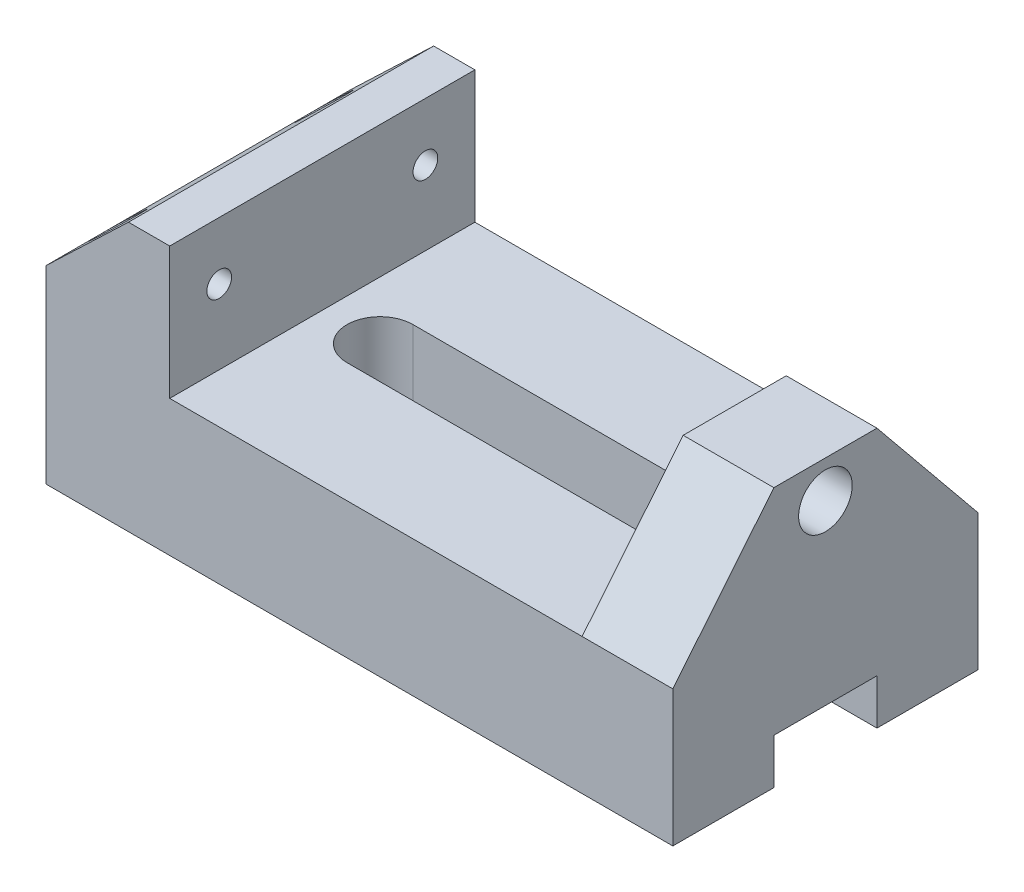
from build123d import *

# Parameters (mm, degrees)
SKETCH1_W           = 152
SKETCH1_H           = 65
BOSS_EXTRUDE1_DEPTH = 37
CHAMFER1_SIZE       = 20
CHAMFER1_SIZE2      = 18
SKETCH2_W           = 100
SKETCH2_H           = 32
CUT_EXTRUDE1_DEPTH  = 74
CHAMFER2_SIZE       = 26.135
CHAMFER2_SIZE2      = 32
CHAMFER3_SIZE       = 32
CHAMFER3_SIZE2      = 26.135
SKETCH3_W           = 25
SKETCH3_H           = 11
CUT_EXTRUDE2_DEPTH  = 152
SKETCH4_R           = 6.5
CUT_EXTRUDE3_DEPTH  = 22
SKETCH5_R           = 8
CUT_EXTRUDE4_DEPTH  = 13
CUT_EXTRUDE5_DEPTH  = 22
SKETCH14_W          = 10
SKETCH14_H          = 74
BOSS_EXTRUDE3_DEPTH = 2
BOSS_EXTRUDE4_DEPTH = 74
SKETCH30_W          = 0.314102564
SKETCH30_H          = 3.5
CUT_EXTRUDE6_DEPTH  = 2
CUT_EXTRUDE7_DEPTH  = 74
CUT_EXTRUDE8_DEPTH  = 22
CUT_EXTRUDE10_START = -74
CUT_EXTRUDE10_DEPTH = 74


with BuildPart() as part:
    # Sketch1 → Boss-Extrude1 (new, symmetric)
    with BuildSketch(Plane.XY):
        Rectangle(SKETCH1_W, SKETCH1_H)
    extrude(amount=BOSS_EXTRUDE1_DEPTH, both=True)

    # Chamfer1
    chamfer1_edges = [part.edges().sort_by_distance(p)[0] for p in [
        (-76, 32.5, 0),
    ]]
    chamfer1_side = [part.faces().sort_by_distance(p)[0] for p in [
        (0, 32.5, 0),
    ]]
    chamfer(chamfer1_edges, length=CHAMFER1_SIZE, length2=CHAMFER1_SIZE2, reference=chamfer1_side[0])

    # Sketch2 → Cut-Extrude1 (cut)
    with BuildSketch(Plane.XY.offset(37)):
        with Locations((4, 16.5)):
            Rectangle(SKETCH2_W, SKETCH2_H)
    extrude(amount=-CUT_EXTRUDE1_DEPTH, mode=Mode.SUBTRACT)

    # Chamfer2
    chamfer2_edges = [part.edges().sort_by_distance(p)[0] for p in [
        (65, 32.5, 37),
    ]]
    chamfer2_side = [part.faces().sort_by_distance(p)[0] for p in [
        (65, 32.5, 0),
    ]]
    chamfer(chamfer2_edges, length=CHAMFER2_SIZE, length2=CHAMFER2_SIZE2, reference=chamfer2_side[0])

    # Chamfer3
    chamfer3_edges = [part.edges().sort_by_distance(p)[0] for p in [
        (65, 32.5, -37),
    ]]
    chamfer3_side = [part.faces().sort_by_distance(p)[0] for p in [
        (-0.049230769, -8.856923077, -37),
    ]]
    chamfer(chamfer3_edges, length=CHAMFER3_SIZE, length2=CHAMFER3_SIZE2, reference=chamfer3_side[0])

    # Sketch3 → Cut-Extrude2 (cut)
    with BuildSketch(Plane(origin=(76, 0, 0), x_dir=(0, 0, -1), z_dir=(1, 0, 0))):
        with Locations((0, -27)):
            Rectangle(SKETCH3_W, SKETCH3_H)
    extrude(amount=-CUT_EXTRUDE2_DEPTH, mode=Mode.SUBTRACT)

    # Sketch4 → Cut-Extrude3 (cut)
    with BuildSketch(Plane(origin=(76, 0, 0), x_dir=(0, 0, -1), z_dir=(1, 0, 0))):
        with Locations((0, 21.5)):
            Circle(SKETCH4_R)
    extrude(amount=-CUT_EXTRUDE3_DEPTH, mode=Mode.SUBTRACT)

    # Sketch5 → Cut-Extrude4 (cut)
    with BuildSketch(Plane.ZY.offset(76)):
        with Locations((0, -7.5)):
            Circle(SKETCH5_R)
    extrude(amount=-CUT_EXTRUDE4_DEPTH, mode=Mode.SUBTRACT)

    # Sketch6 → Cut-Extrude5 (cut)
    with BuildSketch(Plane(origin=(0, 0.5, 0), x_dir=(1, 0, 0), z_dir=(0, 1, 0))):
        with BuildLine():
            Line((-32, 8), (46, 8))
            ThreePointArc((46, 8), (54, 0), (46, -8))
            Line((46, -8), (-32, -8))
            ThreePointArc((-32, -8), (-40, 0), (-32, 8))
        make_face()
    extrude(amount=-CUT_EXTRUDE5_DEPTH, mode=Mode.SUBTRACT)

    # Sketch14 → Boss-Extrude3 (add)
    with BuildSketch(Plane(origin=(0, 32.5, 0), x_dir=(1, 0, 0), z_dir=(0, 1, 0))):
        with Locations((-51, 0)):
            Rectangle(SKETCH14_W, SKETCH14_H)
    extrude(amount=BOSS_EXTRUDE3_DEPTH)

    # Sketch15 → Boss-Extrude4 (add)
    with BuildSketch(Plane.XY.offset(37)):
        Polygon((-56, 34.5), (-76, 14.5), (-56, 14.5), align=None)
    extrude(amount=-BOSS_EXTRUDE4_DEPTH)

    # Sketch29 → CBORE for M6 Cheese Head Screw1 (revolve, cut)
    with BuildSketch(Plane(origin=(-76, 18.5, 25), x_dir=(0, 0, 1), z_dir=(0, 1, 0))):
        Polygon((0, 0), (0, 31.802581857), (3, 30), (3, 16.06), (5, 16.06), (5, 0), align=None)
    cbore_for_m6_cheese_head_screw1 = revolve(axis=Axis((-82.35, 18.5, 25), (1, 0, 0)), mode=Mode.SUBTRACT)

    # Mirror1: CBORE for M6 Cheese Head Screw1 across plane
    add(cbore_for_m6_cheese_head_screw1.mirror(Plane.XY), mode=Mode.SUBTRACT)

    # Sketch30 → Cut-Extrude6 (cut)
    # profile 1 of 18: a face of its own
    with BuildSketch(Plane(origin=(0, 0, -37), x_dir=(-1, 0, 0), z_dir=(0, 0, -1))):
        Polygon((-73.647697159, -31.084365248), (-73.185657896, -27.584365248), (-73.140786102, -27.584365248), (-71.695774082, -30.456160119), (-70.254968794, -27.584365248), (-70.210096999, -27.584365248), (-69.743851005, -31.084365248), (-70.057953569, -31.084365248), (-70.394492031, -28.568039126), (-71.657212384, -31.084365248), (-71.728726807, -31.084365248), (-72.997056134, -28.560326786), (-73.33149123, -31.084365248), align=None)
    # profile 2 of 18: a face of its own
    with BuildSketch(Plane(origin=(0, 0, -37), x_dir=(-1, 0, 0), z_dir=(0, 0, -1))):
        with BuildLine():
            add(Edge.make_bspline(
                [(-67.388081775, -27.494621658), (-67.323273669, -27.496263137), (-67.195985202, -27.499487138), (-67.008910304, -27.524166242), (-66.830315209, -27.566861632), (-66.65874507, -27.623724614), (-66.496252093, -27.699579), (-66.341613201, -27.791264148), (-66.195196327, -27.899740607), (-66.058974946, -28.024169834), (-65.934317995, -28.159553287), (-65.824492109, -28.304031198), (-65.732449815, -28.45673), (-65.656864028, -28.61719083), (-65.597565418, -28.785050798), (-65.556646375, -28.961204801), (-65.530508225, -29.144511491), (-65.527452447, -29.269538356), (-65.525902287, -29.332963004)],
                knots=[0, 0, 0, 0, 1.065120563, 2.091984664, 3.0946048, 4.079830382, 5.057816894, 6.036188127, 7.030412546, 8.04752943, 9.064399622, 10.05169764, 11.02544977, 11.989514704, 12.962713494, 13.945757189, 14.957906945, 16, 16, 16, 16], degree=3))
            add(Edge.make_bspline(
                [(-65.525902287, -29.332963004), (-65.52745222, -29.39592045), (-65.530507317, -29.520016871), (-65.556676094, -29.702160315), (-65.597717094, -29.877251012), (-65.65631336, -30.044996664), (-65.731538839, -30.205574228), (-65.82419401, -30.358561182), (-65.933335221, -30.50400768), (-66.057542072, -30.640320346), (-66.192943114, -30.765317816), (-66.33817338, -30.874236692), (-66.4899667, -30.967960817), (-66.650276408, -31.04274449), (-66.816976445, -31.102516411), (-66.991558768, -31.143269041), (-67.173205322, -31.169556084), (-67.297076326, -31.1725746), (-67.360036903, -31.174108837)],
                knots=[0, 0, 0, 0, 1.043624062, 2.057103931, 3.04512605, 4.022047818, 4.998200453, 5.980619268, 6.982898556, 8.009068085, 9.034988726, 10.034168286, 11.015286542, 11.987931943, 12.962482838, 13.94673481, 14.956375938, 16, 16, 16, 16], degree=3))
            add(Edge.make_bspline(
                [(-67.360036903, -31.174108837), (-67.423461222, -31.172559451), (-67.548487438, -31.169505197), (-67.732024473, -31.143323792), (-67.908302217, -31.102382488), (-68.076816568, -31.043873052), (-68.237661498, -30.968255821), (-68.39115158, -30.876051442), (-68.536670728, -30.766644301), (-68.673012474, -30.642477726), (-68.797761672, -30.507306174), (-68.906521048, -30.362471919), (-68.998746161, -30.210816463), (-69.074109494, -30.051918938), (-69.133773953, -29.886547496), (-69.174478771, -29.713599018), (-69.200814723, -29.534059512), (-69.20384957, -29.411816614), (-69.205389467, -29.349789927)],
                knots=[0, 0, 0, 0, 1.053102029, 2.075944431, 3.073151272, 4.055350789, 5.033113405, 6.020478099, 7.024410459, 8.052272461, 9.079885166, 10.07527673, 11.055994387, 12.023226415, 12.992069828, 13.970394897, 14.97016774, 16, 16, 16, 16], degree=3))
            add(Edge.make_bspline(
                [(-69.205389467, -29.349789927), (-69.204854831, -29.308157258), (-69.203792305, -29.225417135), (-69.191000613, -29.102550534), (-69.172438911, -28.981659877), (-69.145836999, -28.863088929), (-69.111045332, -28.747127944), (-69.069993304, -28.632977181), (-69.019853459, -28.521793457), (-68.963172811, -28.413050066), (-68.899911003, -28.30844216), (-68.830035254, -28.209562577), (-68.755999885, -28.11558158), (-68.674836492, -28.028934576), (-68.589220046, -27.94710092), (-68.497761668, -27.871338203), (-68.401019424, -27.800963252), (-68.298577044, -27.737542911), (-68.192958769, -27.680183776), (-68.084081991, -27.630961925), (-67.97342542, -27.588715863), (-67.860470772, -27.554475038), (-67.745518, -27.527443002), (-67.628316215, -27.509035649), (-67.508958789, -27.496211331), (-67.42854747, -27.495153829), (-67.388081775, -27.494621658)],
                knots=[0, 0, 0, 0, 1.037015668, 2.060948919, 3.074880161, 4.083647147, 5.086022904, 6.090072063, 7.104153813, 8.122640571, 9.144368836, 10.147691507, 11.138137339, 12.123020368, 13.103399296, 14.087645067, 15.080126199, 16.082011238, 17.087798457, 18.072939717, 19.057185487, 20.037253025, 21.01195951, 21.997135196, 22.992090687, 24, 24, 24, 24], degree=3))
        make_face()
        with BuildLine():
            add(Edge.make_bspline(
                [(-67.372657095, -27.853596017), (-67.405871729, -27.854000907), (-67.471983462, -27.854806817), (-67.570267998, -27.865422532), (-67.667259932, -27.880552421), (-67.762979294, -27.902133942), (-67.857025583, -27.931537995), (-67.950275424, -27.965378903), (-68.041878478, -28.006599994), (-68.131532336, -28.053172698), (-68.218447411, -28.104721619), (-68.300460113, -28.161693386), (-68.377782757, -28.22275194), (-68.450226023, -28.288039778), (-68.517577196, -28.357889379), (-68.581161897, -28.431241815), (-68.638431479, -28.510193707), (-68.690917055, -28.592604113), (-68.737884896, -28.678365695), (-68.77965025, -28.766575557), (-68.813814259, -28.857953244), (-68.841676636, -28.951507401), (-68.864776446, -29.047089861), (-68.87941037, -29.14542571), (-68.89014273, -29.246020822), (-68.890902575, -29.314002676), (-68.891286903, -29.348387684)],
                knots=[0, 0, 0, 0, 1.008559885, 2.007477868, 2.99961109, 3.989939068, 4.984837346, 5.991145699, 7.001802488, 8.033829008, 9.059044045, 10.069351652, 11.065060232, 12.050310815, 13.029377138, 14.011219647, 14.996725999, 15.989392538, 16.977580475, 17.965360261, 18.951710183, 19.937753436, 20.929683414, 21.935841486, 22.955955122, 24, 24, 24, 24], degree=3))
            add(Edge.make_bspline(
                [(-68.891286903, -29.348387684), (-68.890012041, -29.398949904), (-68.887503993, -29.498421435), (-68.865546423, -29.644189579), (-68.831724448, -29.784277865), (-68.781867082, -29.917919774), (-68.719516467, -30.046264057), (-68.642489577, -30.168172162), (-68.551230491, -30.283677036), (-68.447566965, -30.391972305), (-68.334244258, -30.490818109), (-68.213911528, -30.577581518), (-68.087857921, -30.650991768), (-67.955754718, -30.71079684), (-67.818307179, -30.758186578), (-67.674629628, -30.790665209), (-67.525679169, -30.812040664), (-67.424148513, -30.81409342), (-67.372657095, -30.815134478)],
                knots=[0, 0, 0, 0, 1.032063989, 2.030389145, 3.003944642, 3.970395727, 4.937377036, 5.913328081, 6.909231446, 7.93887556, 8.970685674, 9.976071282, 10.964166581, 11.944589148, 12.933237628, 13.927779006, 14.949070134, 16, 16, 16, 16], degree=3))
            add(Edge.make_bspline(
                [(-67.372657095, -30.815134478), (-67.338047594, -30.814658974), (-67.269406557, -30.813715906), (-67.167311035, -30.804217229), (-67.067054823, -30.78898536), (-66.968778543, -30.767054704), (-66.872593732, -30.739607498), (-66.778098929, -30.70699977), (-66.686300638, -30.666318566), (-66.596040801, -30.621370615), (-66.509644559, -30.570130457), (-66.427169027, -30.515092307), (-66.350693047, -30.454123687), (-66.278303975, -30.389805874), (-66.210676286, -30.320842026), (-66.148267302, -30.247321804), (-66.09128717, -30.168781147), (-66.038821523, -30.086495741), (-65.992018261, -30.000499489), (-65.951239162, -29.911969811), (-65.916643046, -29.821124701), (-65.888714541, -29.72783313), (-65.866829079, -29.632272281), (-65.851749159, -29.534314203), (-65.841200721, -29.434154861), (-65.840405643, -29.366411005), (-65.840004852, -29.332261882)],
                knots=[0, 0, 0, 0, 1.047197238, 2.076906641, 3.100256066, 4.114471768, 5.12198147, 6.126382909, 7.136867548, 8.15857795, 9.17633901, 10.174870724, 11.156907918, 12.133735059, 13.104061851, 14.077631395, 15.04955518, 16.038496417, 17.029181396, 18.010275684, 18.986308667, 19.968651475, 20.955262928, 21.950658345, 22.966943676, 24, 24, 24, 24], degree=3))
            add(Edge.make_bspline(
                [(-65.840004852, -29.332261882), (-65.840405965, -29.298346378), (-65.841201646, -29.231068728), (-65.851744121, -29.131607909), (-65.866845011, -29.034354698), (-65.888607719, -28.939690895), (-65.916657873, -28.84759237), (-65.951245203, -28.758145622), (-65.992030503, -28.671017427), (-66.038838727, -28.58642313), (-66.09145455, -28.505248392), (-66.148948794, -28.42764598), (-66.212314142, -28.355073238), (-66.279740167, -28.285738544), (-66.352911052, -28.221120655), (-66.431495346, -28.161198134), (-66.514539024, -28.10452486), (-66.602466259, -28.053399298), (-66.693210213, -28.006185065), (-66.786324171, -27.965734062), (-66.880753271, -27.931361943), (-66.976257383, -27.902044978), (-67.073640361, -27.880636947), (-67.17224419, -27.865408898), (-67.271932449, -27.854810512), (-67.338975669, -27.854002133), (-67.372657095, -27.853596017)],
                knots=[0, 0, 0, 0, 1.02996197, 2.043119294, 3.035359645, 4.018872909, 4.991431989, 5.957985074, 6.929999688, 7.912076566, 8.892894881, 9.867085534, 10.843653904, 11.817741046, 12.803660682, 13.806313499, 14.818574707, 15.856120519, 16.894564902, 17.924820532, 18.937903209, 19.946497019, 20.957711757, 21.963978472, 22.977135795, 24, 24, 24, 24], degree=3))
        make_face(mode=Mode.SUBTRACT)
    # profile 3 of 18: a face of its own
    with BuildSketch(Plane(origin=(0, 0, -37), x_dir=(-1, 0, 0), z_dir=(0, 0, -1))):
        Polygon((-64.807953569, -27.584365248), (-64.493851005, -27.584365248), (-64.493851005, -29.020262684), (-62.698979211, -29.020262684), (-62.698979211, -27.584365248), (-62.384876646, -27.584365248), (-62.384876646, -31.084365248), (-62.698979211, -31.084365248), (-62.698979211, -29.379237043), (-64.493851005, -29.379237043), (-64.493851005, -31.084365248), (-64.807953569, -31.084365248), align=None)
    # profile 4 of 18: a face of its own
    with BuildSketch(Plane(origin=(0, 0, -37), x_dir=(-1, 0, 0), z_dir=(0, 0, -1))):
        Polygon((-60.051543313, -27.584365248), (-58.436158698, -31.084365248), (-58.777605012, -31.084365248), (-59.295032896, -29.962570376), (-60.881671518, -29.962570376), (-61.413121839, -31.084365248), (-61.756671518, -31.084365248), (-60.096415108, -27.584365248), align=None)
        Polygon((-60.077484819, -28.267257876), (-60.7105978, -29.603596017), (-59.46049764, -29.603596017), align=None, mode=Mode.SUBTRACT)
    # profile 5 of 18: a face of its own
    with BuildSketch(Plane(origin=(0, 0, -37), x_dir=(-1, 0, 0), z_dir=(0, 0, -1))):
        Polygon((-57.987440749, -31.084365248), (-57.525401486, -27.584365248), (-57.480529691, -27.584365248), (-56.035517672, -30.456160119), (-54.594712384, -27.584365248), (-54.549840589, -27.584365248), (-54.083594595, -31.084365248), (-54.397697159, -31.084365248), (-54.734235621, -28.568039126), (-55.996955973, -31.084365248), (-56.068470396, -31.084365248), (-57.336799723, -28.560326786), (-57.671234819, -31.084365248), align=None)
    # profile 6 of 18: a face of its own
    with BuildSketch(Plane(origin=(0, 0, -37), x_dir=(-1, 0, 0), z_dir=(0, 0, -1))):
        Polygon((-53.545133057, -31.084365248), (-53.083093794, -27.584365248), (-53.038221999, -27.584365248), (-51.59320998, -30.456160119), (-50.152404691, -27.584365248), (-50.107532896, -27.584365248), (-49.641286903, -31.084365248), (-49.955389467, -31.084365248), (-50.291927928, -28.568039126), (-51.554648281, -31.084365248), (-51.626162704, -31.084365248), (-52.894492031, -28.560326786), (-53.228927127, -31.084365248), align=None)
    # profile 7 of 18: a face of its own
    with BuildSketch(Plane(origin=(0, 0, -37), x_dir=(-1, 0, 0), z_dir=(0, 0, -1))):
        Polygon((-47.487440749, -27.584365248), (-45.872056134, -31.084365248), (-46.213502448, -31.084365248), (-46.730930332, -29.962570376), (-48.317568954, -29.962570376), (-48.849019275, -31.084365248), (-49.192568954, -31.084365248), (-47.532312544, -27.584365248), align=None)
        Polygon((-47.513382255, -28.267257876), (-48.146495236, -29.603596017), (-46.896395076, -29.603596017), align=None, mode=Mode.SUBTRACT)
    # profile 8 of 18: a face of its own
    with BuildSketch(Plane(origin=(0, 0, -37), x_dir=(-1, 0, 0), z_dir=(0, 0, -1))):
        with BuildLine():
            Line((-45.243851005, -31.084365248), (-45.243851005, -27.584365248))
            Line((-45.243851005, -27.584365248), (-44.537120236, -27.584365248))
            add(Edge.make_bspline(
                [(-44.537120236, -27.584365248), (-44.475651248, -27.584807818), (-44.356893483, -27.585662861), (-44.185281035, -27.591084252), (-44.026497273, -27.600674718), (-43.881064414, -27.614644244), (-43.748583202, -27.631797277), (-43.629424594, -27.653297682), (-43.522972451, -27.678685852), (-43.45750301, -27.700331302), (-43.426543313, -27.710567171)],
                knots=[0, 0, 0, 0, 1.314313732, 2.53924729, 3.670748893, 4.714932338, 5.66265055, 6.526160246, 7.303039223, 8, 8, 8, 8], degree=3))
            add(Edge.make_bspline(
                [(-43.426543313, -27.710567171), (-43.386048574, -27.725997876), (-43.305977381, -27.75650937), (-43.191970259, -27.814065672), (-43.084644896, -27.879278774), (-42.983425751, -27.952234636), (-42.890624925, -28.034998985), (-42.802617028, -28.12405607), (-42.723002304, -28.222644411), (-42.650094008, -28.328719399), (-42.584358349, -28.441031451), (-42.527219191, -28.559366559), (-42.479765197, -28.683123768), (-42.440371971, -28.811958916), (-42.409325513, -28.946155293), (-42.388143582, -29.085869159), (-42.374172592, -29.230548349), (-42.37276854, -29.328722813), (-42.372056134, -29.378535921)],
                knots=[0, 0, 0, 0, 0.984719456, 1.947108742, 2.898477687, 3.838006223, 4.779231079, 5.722358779, 6.681677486, 7.655904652, 8.64651281, 9.637519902, 10.640069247, 11.656948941, 12.698408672, 13.768548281, 14.867775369, 16, 16, 16, 16], degree=3))
            add(Edge.make_bspline(
                [(-42.372056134, -29.378535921), (-42.372685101, -29.421797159), (-42.373924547, -29.507047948), (-42.385053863, -29.632688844), (-42.401230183, -29.754602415), (-42.426274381, -29.872208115), (-42.456676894, -29.986536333), (-42.495641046, -30.096368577), (-42.540276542, -30.202712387), (-42.59232642, -30.304129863), (-42.649467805, -30.400213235), (-42.710789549, -30.490788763), (-42.776226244, -30.574563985), (-42.846401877, -30.651792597), (-42.920409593, -30.722358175), (-42.998733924, -30.786850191), (-43.081576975, -30.844006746), (-43.168567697, -30.896073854), (-43.262243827, -30.941494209), (-43.364379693, -30.979924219), (-43.475410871, -31.011770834), (-43.595064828, -31.03834173), (-43.723548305, -31.059419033), (-43.860987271, -31.073545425), (-44.007170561, -31.083098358), (-44.107549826, -31.083934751), (-44.159215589, -31.084365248)],
                knots=[0, 0, 0, 0, 1.105936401, 2.179363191, 3.223086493, 4.248585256, 5.251745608, 6.245858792, 7.225916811, 8.198733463, 9.158002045, 10.082870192, 10.993790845, 11.873723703, 12.748670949, 13.606408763, 14.465103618, 15.319838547, 16.196477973, 17.123216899, 18.106603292, 19.147568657, 20.255746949, 21.433717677, 22.679120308, 24, 24, 24, 24], degree=3))
            Line((-44.159215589, -31.084365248), (-45.243851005, -31.084365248))
        make_face()
        with BuildLine():
            Line((-44.929748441, -30.725390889), (-44.528005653, -30.725390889))
            add(Edge.make_bspline(
                [(-44.528005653, -30.725390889), (-44.470277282, -30.725142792), (-44.359244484, -30.724665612), (-44.199586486, -30.720478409), (-44.05370709, -30.713636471), (-43.921585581, -30.704061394), (-43.803296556, -30.691392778), (-43.698592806, -30.677267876), (-43.607817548, -30.659670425), (-43.552888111, -30.643719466), (-43.527504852, -30.636348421)],
                knots=[0, 0, 0, 0, 1.375205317, 2.645023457, 3.804390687, 4.853969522, 5.800190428, 6.637939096, 7.370582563, 8, 8, 8, 8], degree=3))
            add(Edge.make_bspline(
                [(-43.527504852, -30.636348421), (-43.495556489, -30.625096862), (-43.432422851, -30.602862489), (-43.341541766, -30.562304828), (-43.256784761, -30.514262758), (-43.176674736, -30.460860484), (-43.102348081, -30.400214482), (-43.032923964, -30.333643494), (-42.968542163, -30.260808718), (-42.909867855, -30.181800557), (-42.857359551, -30.097110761), (-42.811888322, -30.007571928), (-42.77203679, -29.914165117), (-42.740758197, -29.815455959), (-42.716242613, -29.7123269), (-42.698877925, -29.604770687), (-42.688063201, -29.492807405), (-42.686801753, -29.416655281), (-42.686158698, -29.377834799)],
                knots=[0, 0, 0, 0, 0.998632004, 1.973411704, 2.929992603, 3.868527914, 4.809262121, 5.754881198, 6.702106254, 7.672490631, 8.653608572, 9.636854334, 10.631411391, 11.644891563, 12.686317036, 13.754757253, 14.855430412, 16, 16, 16, 16], degree=3))
            add(Edge.make_bspline(
                [(-42.686158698, -29.377834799), (-42.686671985, -29.336901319), (-42.687680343, -29.256487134), (-42.700354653, -29.138496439), (-42.718876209, -29.025015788), (-42.745659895, -28.916037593), (-42.779790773, -28.811349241), (-42.822385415, -28.711529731), (-42.871052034, -28.615524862), (-42.928955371, -28.525550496), (-42.992370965, -28.440457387), (-43.062748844, -28.362502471), (-43.138970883, -28.291508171), (-43.220205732, -28.226368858), (-43.308742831, -28.169705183), (-43.402496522, -28.119018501), (-43.502842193, -28.07600261), (-43.572654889, -28.053123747), (-43.608133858, -28.041496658)],
                knots=[0, 0, 0, 0, 1.122418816, 2.205001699, 3.251619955, 4.274784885, 5.280384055, 6.268708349, 7.249350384, 8.229342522, 9.199999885, 10.157847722, 11.105861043, 12.055065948, 13.010012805, 13.98527497, 14.976112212, 16, 16, 16, 16], degree=3))
            add(Edge.make_bspline(
                [(-43.608133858, -28.041496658), (-43.637485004, -28.03338023), (-43.699893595, -28.016122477), (-43.801733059, -27.997297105), (-43.916348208, -27.980692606), (-44.044247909, -27.966634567), (-44.185286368, -27.956547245), (-44.339572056, -27.948975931), (-44.507171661, -27.943869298), (-44.623354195, -27.943520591), (-44.683654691, -27.943339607)],
                knots=[0, 0, 0, 0, 0.674548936, 1.434276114, 2.292660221, 3.240891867, 4.284742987, 5.42552168, 6.663806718, 8, 8, 8, 8], degree=3))
            Line((-44.683654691, -27.943339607), (-44.929748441, -27.943339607))
            Line((-44.929748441, -27.943339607), (-44.929748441, -30.725390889))
        make_face(mode=Mode.SUBTRACT)
    # profile 9 of 18: a face of its own
    with BuildSketch(Plane(origin=(0, 0, -37), x_dir=(-1, 0, 0), z_dir=(0, 0, -1))):
        Polygon((-38.872056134, -27.584365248), (-37.256671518, -31.084365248), (-37.598117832, -31.084365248), (-38.115545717, -29.962570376), (-39.702184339, -29.962570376), (-40.233634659, -31.084365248), (-40.577184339, -31.084365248), (-38.916927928, -27.584365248), align=None)
        Polygon((-38.89799764, -28.267257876), (-39.531110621, -29.603596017), (-38.281010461, -29.603596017), align=None, mode=Mode.SUBTRACT)
    # profile 10 of 18: a face of its own
    with BuildSketch(Plane(origin=(0, 0, -37), x_dir=(-1, 0, 0), z_dir=(0, 0, -1))):
        Polygon((-36.807953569, -31.084365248), (-36.345914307, -27.584365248), (-36.301042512, -27.584365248), (-34.856030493, -30.456160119), (-33.415225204, -27.584365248), (-33.370353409, -27.584365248), (-32.904107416, -31.084365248), (-33.21820998, -31.084365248), (-33.554748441, -28.568039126), (-34.817468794, -31.084365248), (-34.888983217, -31.084365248), (-36.157312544, -28.560326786), (-36.49174764, -31.084365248), align=None)
    # profile 11 of 18: a face of its own
    with BuildSketch(Plane(origin=(0, 0, -37), x_dir=(-1, 0, 0), z_dir=(0, 0, -1))):
        with Locations((-32.029107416, -29.334365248)):
            Rectangle(SKETCH30_W, SKETCH30_H)
    # profile 12 of 18: a face of its own
    with BuildSketch(Plane(origin=(0, 0, -37), x_dir=(-1, 0, 0), z_dir=(0, 0, -1))):
        Polygon((-30.974620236, -31.084365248), (-30.974620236, -27.584365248), (-30.908714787, -27.584365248), (-28.596415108, -30.33907278), (-28.596415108, -27.584365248), (-28.282312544, -27.584365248), (-28.282312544, -31.084365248), (-28.353826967, -31.084365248), (-30.660517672, -28.335967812), (-30.660517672, -31.084365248), align=None)
    # profile 13 of 18: a face of its own
    with BuildSketch(Plane(origin=(0, 0, -37), x_dir=(-1, 0, 0), z_dir=(0, 0, -1))):
        with BuildLine():
            Line((-26.397697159, -30.409184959), (-26.101823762, -30.231801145))
            add(Edge.make_bspline(
                [(-26.101823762, -30.231801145), (-26.074305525, -30.27786553), (-26.021581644, -30.366123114), (-25.933630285, -30.485381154), (-25.842497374, -30.586743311), (-25.74750804, -30.669619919), (-25.649242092, -30.734868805), (-25.547058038, -30.781071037), (-25.441300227, -30.809887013), (-25.369326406, -30.813387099), (-25.333394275, -30.815134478)],
                knots=[0, 0, 0, 0, 1.272034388, 2.437168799, 3.508375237, 4.49857839, 5.41946034, 6.295179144, 7.148887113, 8, 8, 8, 8], degree=3))
            add(Edge.make_bspline(
                [(-25.333394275, -30.815134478), (-25.302707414, -30.814279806), (-25.241870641, -30.812585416), (-25.152308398, -30.796304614), (-25.065326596, -30.771292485), (-24.982717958, -30.735471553), (-24.905622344, -30.692133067), (-24.838015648, -30.63978689), (-24.779569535, -30.581180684), (-24.73176042, -30.51579803), (-24.695080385, -30.445480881), (-24.666888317, -30.37330493), (-24.651243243, -30.298136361), (-24.64888649, -30.247525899), (-24.647697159, -30.22198544)],
                knots=[0, 0, 0, 0, 1.095163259, 2.171163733, 3.241058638, 4.321873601, 5.38011039, 6.391990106, 7.366004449, 8.327778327, 9.272591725, 10.192022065, 11.087607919, 12, 12, 12, 12], degree=3))
            add(Edge.make_bspline(
                [(-24.647697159, -30.22198544), (-24.64917147, -30.19284459), (-24.652168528, -30.133605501), (-24.677500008, -30.046205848), (-24.717349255, -29.959713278), (-24.754111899, -29.906212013), (-24.773197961, -29.87843576)],
                knots=[0, 0, 0, 0, 0.938893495, 1.908633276, 2.914225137, 4, 4, 4, 4], degree=3))
            add(Edge.make_bspline(
                [(-24.773197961, -29.87843576), (-24.788868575, -29.858388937), (-24.821767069, -29.816303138), (-24.878324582, -29.753657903), (-24.944690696, -29.689039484), (-25.018594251, -29.619980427), (-25.10272734, -29.54969263), (-25.194454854, -29.474824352), (-25.296118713, -29.398222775), (-25.36741821, -29.34685021), (-25.404207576, -29.320342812)],
                knots=[0, 0, 0, 0, 0.722233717, 1.516239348, 2.393582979, 3.351407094, 4.387010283, 5.505090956, 6.712668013, 8, 8, 8, 8], degree=3))
            add(Edge.make_bspline(
                [(-25.404207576, -29.320342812), (-25.441031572, -29.294114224), (-25.511436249, -29.243967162), (-25.609894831, -29.169542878), (-25.697939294, -29.101499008), (-25.775178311, -29.039194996), (-25.841577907, -28.982622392), (-25.897661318, -28.932324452), (-25.941999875, -28.886940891), (-25.966655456, -28.85749955), (-25.977725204, -28.844281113)],
                knots=[0, 0, 0, 0, 1.452282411, 2.77665338, 3.964542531, 5.026858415, 5.96415736, 6.766646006, 7.446254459, 8, 8, 8, 8], degree=3))
            add(Edge.make_bspline(
                [(-25.977725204, -28.844281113), (-25.993197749, -28.823680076), (-26.023626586, -28.783165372), (-26.063792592, -28.719840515), (-26.097931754, -28.655017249), (-26.124694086, -28.588521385), (-26.147230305, -28.521286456), (-26.162388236, -28.45243521), (-26.171879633, -28.382276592), (-26.172851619, -28.335063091), (-26.173338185, -28.311428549)],
                knots=[0, 0, 0, 0, 1.068054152, 2.10047183, 3.106115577, 4.101338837, 5.06977816, 6.043150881, 7.020423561, 8, 8, 8, 8], degree=3))
            add(Edge.make_bspline(
                [(-26.173338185, -28.311428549), (-26.172032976, -28.274398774), (-26.169450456, -28.201130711), (-26.147609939, -28.09409988), (-26.113137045, -27.991913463), (-26.064842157, -27.895583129), (-26.002584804, -27.807617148), (-25.93053883, -27.727003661), (-25.844727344, -27.659235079), (-25.75057472, -27.600023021), (-25.647518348, -27.553677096), (-25.539527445, -27.518716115), (-25.426430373, -27.498906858), (-25.349827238, -27.496064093), (-25.310958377, -27.494621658)],
                knots=[0, 0, 0, 0, 1.005424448, 1.989358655, 2.955360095, 3.929531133, 4.905563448, 5.876582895, 6.856512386, 7.866279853, 8.892233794, 9.918561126, 10.94386622, 12, 12, 12, 12], degree=3))
            add(Edge.make_bspline(
                [(-25.310958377, -27.494621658), (-25.269714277, -27.49604421), (-25.187692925, -27.498873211), (-25.06704371, -27.523470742), (-24.950882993, -27.564171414), (-24.857439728, -27.610360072), (-24.784306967, -27.656491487), (-24.728534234, -27.698511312), (-24.672016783, -27.74688642), (-24.614298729, -27.801745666), (-24.556358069, -27.863592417), (-24.497334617, -27.932003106), (-24.437090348, -28.006559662), (-24.398334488, -28.059784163), (-24.37846639, -28.087069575)],
                knots=[0, 0, 0, 0, 1.286793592, 2.559021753, 3.825965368, 5.121522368, 5.803751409, 6.523245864, 7.299691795, 8.125521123, 9.008227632, 9.944561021, 10.946284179, 12, 12, 12, 12], degree=3))
            Line((-24.37846639, -28.087069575), (-24.662420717, -28.302313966))
            add(Edge.make_bspline(
                [(-24.662420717, -28.302313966), (-24.679566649, -28.280225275), (-24.712585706, -28.237687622), (-24.762715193, -28.178116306), (-24.809963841, -28.123699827), (-24.856514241, -28.076434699), (-24.899907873, -28.033732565), (-24.942024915, -27.997172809), (-24.982259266, -27.966397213), (-25.032976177, -27.933553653), (-25.096693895, -27.90099715), (-25.176678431, -27.873448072), (-25.260264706, -27.85689301), (-25.317194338, -27.854704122), (-25.346014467, -27.853596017)],
                knots=[0, 0, 0, 0, 1.181633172, 2.275549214, 3.290209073, 4.226197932, 5.078386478, 5.862611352, 6.581680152, 7.217281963, 8.414376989, 9.595101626, 10.782541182, 12, 12, 12, 12], degree=3))
            add(Edge.make_bspline(
                [(-25.346014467, -27.853596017), (-25.382170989, -27.854807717), (-25.451895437, -27.857144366), (-25.550885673, -27.882664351), (-25.639979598, -27.922846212), (-25.716532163, -27.97916119), (-25.78026914, -28.045882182), (-25.826374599, -28.122661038), (-25.854124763, -28.20744344), (-25.857511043, -28.266585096), (-25.859235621, -28.296704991)],
                knots=[0, 0, 0, 0, 1.14458467, 2.207223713, 3.21896685, 4.227309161, 5.202851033, 6.127160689, 7.046193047, 8, 8, 8, 8], degree=3))
            add(Edge.make_bspline(
                [(-25.859235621, -28.296704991), (-25.858842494, -28.31545647), (-25.858055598, -28.352990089), (-25.8470808, -28.408441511), (-25.832981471, -28.463752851), (-25.81063884, -28.518675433), (-25.779793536, -28.574169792), (-25.73928836, -28.63119153), (-25.688275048, -28.690243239), (-25.649198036, -28.728650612), (-25.62856655, -28.748928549)],
                knots=[0, 0, 0, 0, 0.858281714, 1.717966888, 2.583508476, 3.4729293, 4.427298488, 5.488583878, 6.674047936, 8, 8, 8, 8], degree=3))
            add(Edge.make_bspline(
                [(-25.62856655, -28.748928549), (-25.620905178, -28.755765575), (-25.602703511, -28.772008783), (-25.569427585, -28.798601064), (-25.525484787, -28.831403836), (-25.472022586, -28.871991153), (-25.408055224, -28.919072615), (-25.333575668, -28.972046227), (-25.249414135, -29.032631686), (-25.189692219, -29.074989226), (-25.158113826, -29.097386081)],
                knots=[0, 0, 0, 0, 0.420754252, 0.999615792, 1.744751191, 2.668019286, 3.750313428, 4.999500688, 6.413464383, 8, 8, 8, 8], degree=3))
            add(Edge.make_bspline(
                [(-25.158113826, -29.097386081), (-25.120127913, -29.125027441), (-25.046573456, -29.178551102), (-24.941915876, -29.258966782), (-24.847022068, -29.337614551), (-24.761558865, -29.413992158), (-24.684681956, -29.487520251), (-24.617244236, -29.559083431), (-24.558558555, -29.628169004), (-24.495379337, -29.71674158), (-24.430821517, -29.825522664), (-24.37538001, -29.958800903), (-24.340421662, -30.092597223), (-24.335850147, -30.182524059), (-24.333594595, -30.226893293)],
                knots=[0, 0, 0, 0, 1.163667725, 2.253281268, 3.268753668, 4.215851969, 5.092017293, 5.902905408, 6.650798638, 7.335211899, 8.59617414, 9.77448103, 10.901945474, 12, 12, 12, 12], degree=3))
            add(Edge.make_bspline(
                [(-24.333594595, -30.226893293), (-24.334251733, -30.258271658), (-24.335553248, -30.320419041), (-24.350514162, -30.411674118), (-24.372433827, -30.500304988), (-24.405471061, -30.5852161), (-24.445794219, -30.667960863), (-24.496960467, -30.746368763), (-24.556268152, -30.822175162), (-24.624301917, -30.893358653), (-24.698747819, -30.958704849), (-24.777431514, -31.016833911), (-24.860481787, -31.065302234), (-24.947448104, -31.104853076), (-25.03835044, -31.135786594), (-25.133158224, -31.158199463), (-25.232027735, -31.171955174), (-25.299228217, -31.173382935), (-25.333394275, -31.174108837)],
                knots=[0, 0, 0, 0, 0.983748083, 1.948392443, 2.894712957, 3.844097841, 4.80183111, 5.778335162, 6.776009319, 7.81870978, 8.863265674, 9.881300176, 10.883814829, 11.87499822, 12.874611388, 13.892143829, 14.928324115, 16, 16, 16, 16], degree=3))
            add(Edge.make_bspline(
                [(-25.333394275, -31.174108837), (-25.359829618, -31.173597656), (-25.412367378, -31.17258173), (-25.49007686, -31.16360045), (-25.566216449, -31.150893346), (-25.639830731, -31.130719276), (-25.711868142, -31.106242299), (-25.782015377, -31.076103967), (-25.850306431, -31.039986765), (-25.917124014, -30.998691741), (-25.982298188, -30.950633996), (-26.045217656, -30.8946605), (-26.107946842, -30.832314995), (-26.168634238, -30.761904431), (-26.228507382, -30.684566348), (-26.286385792, -30.599577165), (-26.34346751, -30.507399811), (-26.379282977, -30.442534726), (-26.397697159, -30.409184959)],
                knots=[0, 0, 0, 0, 0.915332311, 1.819136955, 2.706846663, 3.586547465, 4.459518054, 5.340707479, 6.227863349, 7.133153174, 8.059268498, 9.028702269, 10.047606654, 11.120612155, 12.245963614, 13.433783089, 14.680604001, 16, 16, 16, 16], degree=3))
        make_face()
    # profile 14 of 18: a face of its own
    with BuildSketch(Plane(origin=(0, 0, -37), x_dir=(-1, 0, 0), z_dir=(0, 0, -1))):
        Polygon((-23.615645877, -27.584365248), (-23.301543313, -27.584365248), (-23.301543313, -29.020262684), (-21.506671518, -29.020262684), (-21.506671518, -27.584365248), (-21.192568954, -27.584365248), (-21.192568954, -31.084365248), (-21.506671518, -31.084365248), (-21.506671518, -29.379237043), (-23.301543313, -29.379237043), (-23.301543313, -31.084365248), (-23.615645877, -31.084365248), align=None)
    # profile 15 of 18: a face of its own
    with BuildSketch(Plane(origin=(0, 0, -37), x_dir=(-1, 0, 0), z_dir=(0, 0, -1))):
        Polygon((-18.859235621, -27.584365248), (-17.243851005, -31.084365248), (-17.585297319, -31.084365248), (-18.102725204, -29.962570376), (-19.689363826, -29.962570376), (-20.220814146, -31.084365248), (-20.564363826, -31.084365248), (-18.904107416, -27.584365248), align=None)
        Polygon((-18.885177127, -28.267257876), (-19.518290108, -29.603596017), (-18.268189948, -29.603596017), align=None, mode=Mode.SUBTRACT)
    # profile 16 of 18: a face of its own
    with BuildSketch(Plane(origin=(0, 0, -37), x_dir=(-1, 0, 0), z_dir=(0, 0, -1))):
        with BuildLine():
            Line((-16.615645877, -27.584365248), (-15.915225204, -27.584365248))
            add(Edge.make_bspline(
                [(-15.915225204, -27.584365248), (-15.868484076, -27.584520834), (-15.778735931, -27.584819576), (-15.650162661, -27.586485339), (-15.533335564, -27.591259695), (-15.428315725, -27.595368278), (-15.33510507, -27.602860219), (-15.253417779, -27.610020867), (-15.183630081, -27.619394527), (-15.14138423, -27.62809995), (-15.122256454, -27.63204153)],
                knots=[0, 0, 0, 0, 1.410062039, 2.707475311, 3.878576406, 4.937260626, 5.877586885, 6.699081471, 7.410979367, 8, 8, 8, 8], degree=3))
            add(Edge.make_bspline(
                [(-15.122256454, -27.63204153), (-15.09664983, -27.638368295), (-15.04598284, -27.650886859), (-14.973032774, -27.67734646), (-14.903518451, -27.707966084), (-14.837728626, -27.743929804), (-14.775992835, -27.785504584), (-14.717674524, -27.831972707), (-14.662509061, -27.883079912), (-14.612727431, -27.940114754), (-14.565788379, -27.999951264), (-14.526199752, -28.06465502), (-14.492073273, -28.132316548), (-14.464902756, -28.203623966), (-14.443024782, -28.277885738), (-14.427598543, -28.355774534), (-14.418347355, -28.436935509), (-14.4174055, -28.492293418), (-14.416927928, -28.520362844)],
                knots=[0, 0, 0, 0, 1.027469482, 2.033020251, 3.019912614, 3.986113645, 4.951240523, 5.91722682, 6.890402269, 7.87763091, 8.8651537, 9.85103654, 10.82876324, 11.815024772, 12.821070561, 13.842952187, 14.906261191, 16, 16, 16, 16], degree=3))
            add(Edge.make_bspline(
                [(-14.416927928, -28.520362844), (-14.418396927, -28.566997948), (-14.421263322, -28.657995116), (-14.447988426, -28.790055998), (-14.491764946, -28.913245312), (-14.552088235, -29.02740795), (-14.62890771, -29.130318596), (-14.721232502, -29.220709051), (-14.829114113, -29.296348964), (-14.929543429, -29.348801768), (-15.018257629, -29.382394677), (-15.091290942, -29.406031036), (-15.170957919, -29.424293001), (-15.256495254, -29.440653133), (-15.348258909, -29.453004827), (-15.446028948, -29.462051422), (-15.5498751, -29.46770547), (-15.621214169, -29.468547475), (-15.657913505, -29.468980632)],
                knots=[0, 0, 0, 0, 1.260483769, 2.459530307, 3.627416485, 4.787058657, 5.939039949, 7.08810263, 8.267026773, 9.491475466, 10.141966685, 10.831826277, 11.566392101, 12.351337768, 13.187381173, 14.07005841, 15.007169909, 16, 16, 16, 16], degree=3))
            Line((-15.657913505, -29.468980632), (-14.372056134, -31.084365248))
            Line((-14.372056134, -31.084365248), (-14.760477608, -31.084365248))
            Line((-14.760477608, -31.084365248), (-16.04633498, -29.468980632))
            Line((-16.04633498, -29.468980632), (-16.301543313, -29.468980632))
            Line((-16.301543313, -29.468980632), (-16.301543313, -31.084365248))
            Line((-16.301543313, -31.084365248), (-16.615645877, -31.084365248))
            Line((-16.615645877, -31.084365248), (-16.615645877, -27.584365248))
        make_face()
        with BuildLine():
            Line((-16.301543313, -27.943339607), (-16.301543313, -29.110006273))
            Line((-16.301543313, -29.110006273), (-15.660717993, -29.114914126))
            add(Edge.make_bspline(
                [(-15.660717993, -29.114914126), (-15.630797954, -29.114927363), (-15.572804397, -29.114953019), (-15.488903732, -29.110959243), (-15.41078362, -29.106415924), (-15.338742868, -29.099466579), (-15.272749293, -29.090510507), (-15.212835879, -29.079307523), (-15.158904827, -29.06625546), (-15.096006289, -29.046053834), (-15.025769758, -29.014047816), (-14.949438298, -28.967482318), (-14.88443596, -28.908913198), (-14.829518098, -28.841939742), (-14.785388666, -28.768303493), (-14.754276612, -28.688887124), (-14.73453417, -28.605695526), (-14.732205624, -28.548517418), (-14.731030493, -28.519661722)],
                knots=[0, 0, 0, 0, 1.146690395, 2.22261258, 3.21895312, 4.145990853, 4.996080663, 5.770904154, 6.481378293, 7.121626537, 8.300444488, 9.431385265, 10.535395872, 11.636531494, 12.74115979, 13.810798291, 14.895190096, 16, 16, 16, 16], degree=3))
            add(Edge.make_bspline(
                [(-14.731030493, -28.519661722), (-14.732232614, -28.491515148), (-14.734614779, -28.43573891), (-14.754063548, -28.354082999), (-14.786952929, -28.277016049), (-14.831275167, -28.204851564), (-14.885274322, -28.139345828), (-14.948592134, -28.083298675), (-15.01949733, -28.037049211), (-15.085768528, -28.00749483), (-15.14500274, -27.989374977), (-15.196432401, -27.976623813), (-15.254543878, -27.966379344), (-15.319619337, -27.958171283), (-15.391380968, -27.951116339), (-15.470191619, -27.94636456), (-15.555528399, -27.943550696), (-15.61467533, -27.943411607), (-15.645293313, -27.943339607)],
                knots=[0, 0, 0, 0, 1.101028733, 2.181837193, 3.264309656, 4.369019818, 5.486613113, 6.575447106, 7.666700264, 8.788928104, 9.402425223, 10.0903467, 10.862060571, 11.710948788, 12.657782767, 13.684531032, 14.801375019, 16, 16, 16, 16], degree=3))
            Line((-15.645293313, -27.943339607), (-16.301543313, -27.943339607))
        make_face(mode=Mode.SUBTRACT)
    # profile 17 of 18: a face of its own
    with BuildSketch(Plane(origin=(0, 0, -37), x_dir=(-1, 0, 0), z_dir=(0, 0, -1))):
        with Locations((-13.497056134, -29.334365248)):
            Rectangle(SKETCH30_W, SKETCH30_H)
    # profile 18 of 18: a face of its own
    with BuildSketch(Plane(origin=(0, 0, -37), x_dir=(-1, 0, 0), z_dir=(0, 0, -1))):
        Polygon((-12.442568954, -27.584365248), (-10.737440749, -27.584365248), (-10.737440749, -27.943339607), (-12.12846639, -27.943339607), (-12.12846639, -29.020262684), (-10.737440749, -29.020262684), (-10.737440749, -29.379237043), (-12.12846639, -29.379237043), (-12.12846639, -31.084365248), (-12.442568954, -31.084365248), align=None)
    extrude(amount=-CUT_EXTRUDE6_DEPTH, mode=Mode.SUBTRACT)

    # Sketch31 → Cut-Extrude7 (cut)
    with BuildSketch(Plane.XY.offset(37)):
        Polygon((-46, 32.5), (-58, 32.5), (-56, 34.5), (-46, 34.5), align=None)
    extrude(amount=-CUT_EXTRUDE7_DEPTH, mode=Mode.SUBTRACT)

    # Sketch32 → Cut-Extrude8 (cut)
    with BuildSketch(Plane(origin=(76, 0, 0), x_dir=(0, 0, -1), z_dir=(1, 0, 0))):
        Polygon((-12.4984375, 30.5), (12.4984375, 30.5), (10.865, 32.5), (-10.865, 32.5), align=None)
    extrude(amount=-CUT_EXTRUDE8_DEPTH, mode=Mode.SUBTRACT)

    # Sketch33 → Cut-Extrude10 (cut)
    with BuildSketch(Plane.XY.offset(37).offset(CUT_EXTRUDE10_START)):
        Polygon((-76, 13.390273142), (-56, 32.5), (-60.83407361, 32.5), (-76, 15.278105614), align=None)
    extrude(amount=CUT_EXTRUDE10_DEPTH, mode=Mode.SUBTRACT)


solid = part.part
